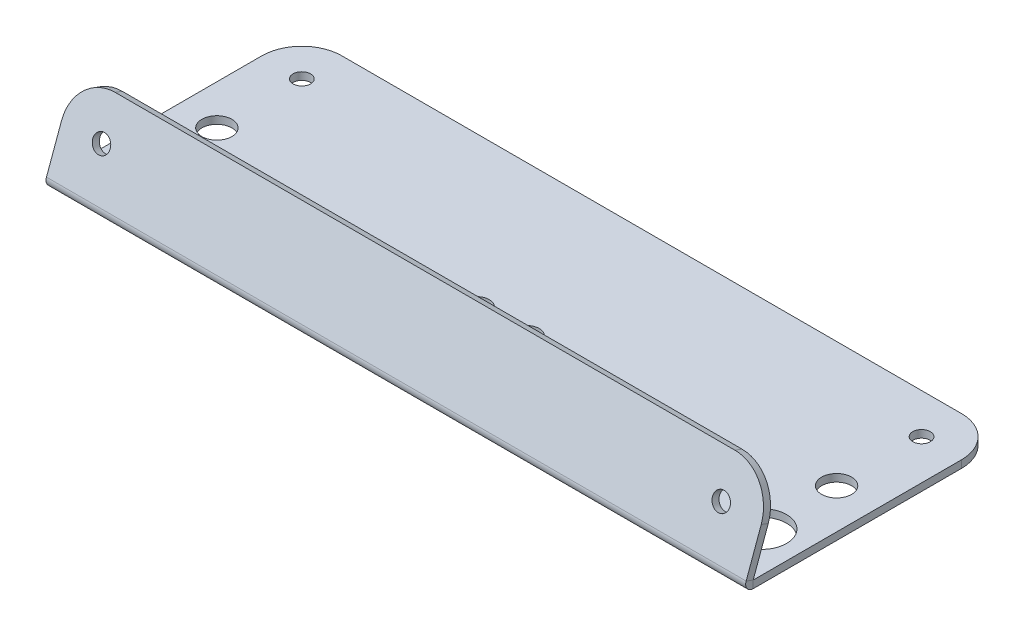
ISO-10303-21;
HEADER;
FILE_DESCRIPTION(('STEP AP214'),'2;1');
FILE_NAME('part.step','',(''),(''),'','','');
FILE_SCHEMA(('AUTOMOTIVE_DESIGN { 1 0 10303 214 1 1 1 1 }'));
ENDSEC;
DATA;
#1=APPLICATION_CONTEXT('core data for automotive mechanical design processes');
#2=APPLICATION_PROTOCOL_DEFINITION('international standard','automotive_design',2000,#1);
#3=PRODUCT_CONTEXT('',#1,'mechanical');
#4=PRODUCT('Part','Part','',(#3));
#5=PRODUCT_RELATED_PRODUCT_CATEGORY('part','',(#4));
#6=PRODUCT_DEFINITION_FORMATION('','',#4);
#7=PRODUCT_DEFINITION_CONTEXT('part definition',#1,'design');
#8=PRODUCT_DEFINITION('design','',#6,#7);
#9=PRODUCT_DEFINITION_SHAPE('','',#8);
#10=(LENGTH_UNIT() NAMED_UNIT(*) SI_UNIT(.MILLI.,.METRE.));
#11=(NAMED_UNIT(*) PLANE_ANGLE_UNIT() SI_UNIT($,.RADIAN.));
#12=(NAMED_UNIT(*) SI_UNIT($,.STERADIAN.) SOLID_ANGLE_UNIT());
#13=UNCERTAINTY_MEASURE_WITH_UNIT(LENGTH_MEASURE(1.E-05),#10,'distance_accuracy_value','');
#14=(GEOMETRIC_REPRESENTATION_CONTEXT(3) GLOBAL_UNCERTAINTY_ASSIGNED_CONTEXT((#13)) GLOBAL_UNIT_ASSIGNED_CONTEXT((#10,
#11,#12)) REPRESENTATION_CONTEXT('',''));
#15=CARTESIAN_POINT('',(0.,0.,0.));
#16=DIRECTION('',(0.,0.,1.));
#17=DIRECTION('',(1.,0.,0.));
#18=AXIS2_PLACEMENT_3D('',#15,#16,#17);
#19=CARTESIAN_POINT('',(132.,-39.0617781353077,-3.54321444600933));
#20=DIRECTION('',(0.,-0.342020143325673,-0.939692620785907));
#21=DIRECTION('',(0.,0.939692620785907,-0.342020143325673));
#22=AXIS2_PLACEMENT_3D('',#19,#20,#21);
#23=PLANE('',#22);
#24=CARTESIAN_POINT('',(132.,9.80223814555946,-21.3282618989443));
#25=DIRECTION('',(0.,-0.342020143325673,-0.939692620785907));
#26=DIRECTION('',(0.,0.939692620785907,-0.342020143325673));
#27=AXIS2_PLACEMENT_3D('',#24,#25,#26);
#28=CIRCLE('',#27,1.75000000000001);
#29=CARTESIAN_POINT('',(132.,11.4467002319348,-21.9267971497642));
#30=VERTEX_POINT('',#29);
#31=EDGE_CURVE('E173',#30,#30,#28,.T.);
#32=ORIENTED_EDGE('',*,*,#31,.F.);
#33=EDGE_LOOP('',(#32));
#34=FACE_BOUND('',#33,.T.);
#35=CARTESIAN_POINT('',(8.,9.80223814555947,-21.3282618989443));
#36=DIRECTION('',(0.,-0.342020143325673,-0.939692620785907));
#37=DIRECTION('',(0.,0.939692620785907,-0.342020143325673));
#38=AXIS2_PLACEMENT_3D('',#35,#36,#37);
#39=CIRCLE('',#38,1.75);
#40=CARTESIAN_POINT('',(8.,11.4467002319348,-21.9267971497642));
#41=VERTEX_POINT('',#40);
#42=EDGE_CURVE('E214',#41,#41,#39,.T.);
#43=ORIENTED_EDGE('',*,*,#42,.F.);
#44=EDGE_LOOP('',(#43));
#45=FACE_BOUND('',#44,.T.);
#46=DIRECTION('',(0.,-0.939692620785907,0.342020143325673));
#47=VECTOR('',#46,1.);
#48=CARTESIAN_POINT('',(140.,9.80223814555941,-21.3282618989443));
#49=LINE('',#48,#47);
#50=CARTESIAN_POINT('',(140.,9.80223814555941,-21.3282618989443));
#51=VERTEX_POINT('',#50);
#52=CARTESIAN_POINT('',(140.,1.51342019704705,-18.3113789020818));
#53=VERTEX_POINT('',#52);
#54=EDGE_CURVE('E44',#51,#53,#49,.T.);
#55=ORIENTED_EDGE('',*,*,#54,.T.);
#56=DIRECTION('',(-1.,0.,0.));
#57=VECTOR('',#56,1.);
#58=CARTESIAN_POINT('',(132.,1.51342020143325,-18.3113788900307));
#59=LINE('',#58,#57);
#60=CARTESIAN_POINT('',(0.,1.51342020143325,-18.3113788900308));
#61=VERTEX_POINT('',#60);
#62=EDGE_CURVE('E141',#53,#61,#59,.T.);
#63=ORIENTED_EDGE('',*,*,#62,.T.);
#64=DIRECTION('',(0.,0.939692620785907,-0.342020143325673));
#65=VECTOR('',#64,1.);
#66=CARTESIAN_POINT('',(0.,9.80223814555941,-21.3282618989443));
#67=LINE('',#66,#65);
#68=CARTESIAN_POINT('',(0.,9.80223814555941,-21.3282618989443));
#69=VERTEX_POINT('',#68);
#70=EDGE_CURVE('E160',#61,#69,#67,.T.);
#71=ORIENTED_EDGE('',*,*,#70,.T.);
#72=CARTESIAN_POINT('',(8.,9.80223814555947,-21.3282618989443));
#73=DIRECTION('',(0.,-0.342020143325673,-0.939692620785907));
#74=DIRECTION('',(0.,0.939692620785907,-0.342020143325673));
#75=AXIS2_PLACEMENT_3D('',#72,#73,#74);
#76=CIRCLE('',#75,8.);
#77=CARTESIAN_POINT('',(8.00000000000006,17.3197791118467,-24.0644230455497));
#78=VERTEX_POINT('',#77);
#79=EDGE_CURVE('E174',#69,#78,#76,.T.);
#80=ORIENTED_EDGE('',*,*,#79,.T.);
#81=DIRECTION('',(1.,0.,0.));
#82=VECTOR('',#81,1.);
#83=CARTESIAN_POINT('',(8.00000000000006,17.3197791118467,-24.0644230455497));
#84=LINE('',#83,#82);
#85=CARTESIAN_POINT('',(132.,17.3197791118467,-24.0644230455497));
#86=VERTEX_POINT('',#85);
#87=EDGE_CURVE('E178',#78,#86,#84,.T.);
#88=ORIENTED_EDGE('',*,*,#87,.T.);
#89=CARTESIAN_POINT('',(132.,9.80223814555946,-21.3282618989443));
#90=DIRECTION('',(0.,-0.342020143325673,-0.939692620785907));
#91=DIRECTION('',(0.,0.939692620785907,-0.342020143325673));
#92=AXIS2_PLACEMENT_3D('',#89,#90,#91);
#93=CIRCLE('',#92,8.);
#94=EDGE_CURVE('E64',#86,#51,#93,.T.);
#95=ORIENTED_EDGE('',*,*,#94,.T.);
#96=EDGE_LOOP('',(#55,#63,#71,#80,#88,#95));
#97=FACE_BOUND('',#96,.T.);
#98=ADVANCED_FACE('F40',(#34,#45,#97),#23,.T.);
#99=CARTESIAN_POINT('',(132.,-38.5487479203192,-2.13367551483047));
#100=DIRECTION('',(0.,-0.342020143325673,-0.939692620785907));
#101=DIRECTION('',(0.,0.939692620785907,-0.342020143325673));
#102=AXIS2_PLACEMENT_3D('',#99,#100,#101);
#103=PLANE('',#102);
#104=DIRECTION('',(-1.,0.,0.));
#105=VECTOR('',#104,1.);
#106=CARTESIAN_POINT('',(132.,2.02645041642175,-16.9018399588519));
#107=LINE('',#106,#105);
#108=CARTESIAN_POINT('',(140.,2.02645041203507,-16.9018399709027));
#109=VERTEX_POINT('',#108);
#110=CARTESIAN_POINT('',(0.,2.02645041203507,-16.9018399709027));
#111=VERTEX_POINT('',#110);
#112=EDGE_CURVE('E49',#109,#111,#107,.T.);
#113=ORIENTED_EDGE('',*,*,#112,.F.);
#114=DIRECTION('',(0.,-0.939692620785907,0.342020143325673));
#115=VECTOR('',#114,1.);
#116=CARTESIAN_POINT('',(140.,10.3152683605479,-19.9187229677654));
#117=LINE('',#116,#115);
#118=CARTESIAN_POINT('',(140.,10.3152683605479,-19.9187229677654));
#119=VERTEX_POINT('',#118);
#120=EDGE_CURVE('E155',#119,#109,#117,.T.);
#121=ORIENTED_EDGE('',*,*,#120,.F.);
#122=CARTESIAN_POINT('',(132.,10.315268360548,-19.9187229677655));
#123=DIRECTION('',(0.,-0.342020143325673,-0.939692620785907));
#124=DIRECTION('',(0.,0.939692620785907,-0.342020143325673));
#125=AXIS2_PLACEMENT_3D('',#122,#123,#124);
#126=CIRCLE('',#125,8.);
#127=CARTESIAN_POINT('',(132.,17.8328093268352,-22.6548841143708));
#128=VERTEX_POINT('',#127);
#129=EDGE_CURVE('E161',#128,#119,#126,.T.);
#130=ORIENTED_EDGE('',*,*,#129,.F.);
#131=DIRECTION('',(1.,0.,0.));
#132=VECTOR('',#131,1.);
#133=CARTESIAN_POINT('',(8.00000000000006,17.8328093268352,-22.6548841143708));
#134=LINE('',#133,#132);
#135=CARTESIAN_POINT('',(8.00000000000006,17.8328093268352,-22.6548841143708));
#136=VERTEX_POINT('',#135);
#137=EDGE_CURVE('E204',#136,#128,#134,.T.);
#138=ORIENTED_EDGE('',*,*,#137,.F.);
#139=CARTESIAN_POINT('',(8.,10.315268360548,-19.9187229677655));
#140=DIRECTION('',(0.,-0.342020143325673,-0.939692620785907));
#141=DIRECTION('',(0.,0.939692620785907,-0.342020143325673));
#142=AXIS2_PLACEMENT_3D('',#139,#140,#141);
#143=CIRCLE('',#142,8.);
#144=CARTESIAN_POINT('',(0.,10.3152683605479,-19.9187229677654));
#145=VERTEX_POINT('',#144);
#146=EDGE_CURVE('E172',#145,#136,#143,.T.);
#147=ORIENTED_EDGE('',*,*,#146,.F.);
#148=DIRECTION('',(0.,0.939692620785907,-0.342020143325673));
#149=VECTOR('',#148,1.);
#150=CARTESIAN_POINT('',(0.,10.3152683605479,-19.9187229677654));
#151=LINE('',#150,#149);
#152=EDGE_CURVE('E167',#111,#145,#151,.T.);
#153=ORIENTED_EDGE('',*,*,#152,.F.);
#154=EDGE_LOOP('',(#113,#121,#130,#138,#147,#153));
#155=FACE_BOUND('',#154,.T.);
#156=CARTESIAN_POINT('',(132.,10.315268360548,-19.9187229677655));
#157=DIRECTION('',(0.,-0.342020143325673,-0.939692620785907));
#158=DIRECTION('',(0.,0.939692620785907,-0.342020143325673));
#159=AXIS2_PLACEMENT_3D('',#156,#157,#158);
#160=CIRCLE('',#159,1.75000000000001);
#161=CARTESIAN_POINT('',(132.,11.9597304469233,-20.5172582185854));
#162=VERTEX_POINT('',#161);
#163=EDGE_CURVE('E211',#162,#162,#160,.T.);
#164=ORIENTED_EDGE('',*,*,#163,.T.);
#165=EDGE_LOOP('',(#164));
#166=FACE_BOUND('',#165,.T.);
#167=CARTESIAN_POINT('',(8.,10.315268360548,-19.9187229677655));
#168=DIRECTION('',(0.,-0.342020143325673,-0.939692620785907));
#169=DIRECTION('',(0.,0.939692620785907,-0.342020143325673));
#170=AXIS2_PLACEMENT_3D('',#167,#168,#169);
#171=CIRCLE('',#170,1.75);
#172=CARTESIAN_POINT('',(8.,11.9597304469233,-20.5172582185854));
#173=VERTEX_POINT('',#172);
#174=EDGE_CURVE('E217',#173,#173,#171,.T.);
#175=ORIENTED_EDGE('',*,*,#174,.T.);
#176=EDGE_LOOP('',(#175));
#177=FACE_BOUND('',#176,.T.);
#178=ADVANCED_FACE('F164',(#155,#166,#177),#103,.F.);
#179=CARTESIAN_POINT('',(0.,9.80223814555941,-21.3282618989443));
#180=DIRECTION('',(1.,0.,0.));
#181=DIRECTION('',(0.,-0.939692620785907,0.342020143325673));
#182=AXIS2_PLACEMENT_3D('',#179,#180,#181);
#183=PLANE('',#182);
#184=DIRECTION('',(0.,-0.342020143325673,-0.939692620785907));
#185=VECTOR('',#184,1.);
#186=CARTESIAN_POINT('',(0.,1.51342020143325,-18.3113788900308));
#187=LINE('',#186,#185);
#188=EDGE_CURVE('E12',#111,#61,#187,.T.);
#189=ORIENTED_EDGE('',*,*,#188,.F.);
#190=ORIENTED_EDGE('',*,*,#152,.T.);
#191=DIRECTION('',(0.,0.342020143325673,0.939692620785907));
#192=VECTOR('',#191,1.);
#193=CARTESIAN_POINT('',(0.,9.80223814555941,-21.3282618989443));
#194=LINE('',#193,#192);
#195=EDGE_CURVE('E194',#69,#145,#194,.T.);
#196=ORIENTED_EDGE('',*,*,#195,.F.);
#197=ORIENTED_EDGE('',*,*,#70,.F.);
#198=EDGE_LOOP('',(#189,#190,#196,#197));
#199=FACE_BOUND('',#198,.T.);
#200=ADVANCED_FACE('F42',(#199),#183,.F.);
#201=CARTESIAN_POINT('',(8.,9.80223814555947,-21.3282618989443));
#202=DIRECTION('',(0.,0.342020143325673,0.939692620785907));
#203=DIRECTION('',(0.,-0.939692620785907,0.342020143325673));
#204=AXIS2_PLACEMENT_3D('',#201,#202,#203);
#205=CYLINDRICAL_SURFACE('',#204,8.);
#206=ORIENTED_EDGE('',*,*,#146,.T.);
#207=DIRECTION('',(0.,0.342020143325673,0.939692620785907));
#208=VECTOR('',#207,1.);
#209=CARTESIAN_POINT('',(8.00000000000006,17.3197791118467,-24.0644230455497));
#210=LINE('',#209,#208);
#211=EDGE_CURVE('E191',#78,#136,#210,.T.);
#212=ORIENTED_EDGE('',*,*,#211,.F.);
#213=ORIENTED_EDGE('',*,*,#79,.F.);
#214=ORIENTED_EDGE('',*,*,#195,.T.);
#215=EDGE_LOOP('',(#206,#212,#213,#214));
#216=FACE_BOUND('',#215,.T.);
#217=ADVANCED_FACE('F198',(#216),#205,.T.);
#218=CARTESIAN_POINT('',(8.00000000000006,17.3197791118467,-24.0644230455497));
#219=DIRECTION('',(0.,-0.939692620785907,0.342020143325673));
#220=DIRECTION('',(-1.,0.,0.));
#221=AXIS2_PLACEMENT_3D('',#218,#219,#220);
#222=PLANE('',#221);
#223=ORIENTED_EDGE('',*,*,#137,.T.);
#224=DIRECTION('',(0.,0.342020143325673,0.939692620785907));
#225=VECTOR('',#224,1.);
#226=CARTESIAN_POINT('',(132.,17.3197791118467,-24.0644230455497));
#227=LINE('',#226,#225);
#228=EDGE_CURVE('E188',#86,#128,#227,.T.);
#229=ORIENTED_EDGE('',*,*,#228,.F.);
#230=ORIENTED_EDGE('',*,*,#87,.F.);
#231=ORIENTED_EDGE('',*,*,#211,.T.);
#232=EDGE_LOOP('',(#223,#229,#230,#231));
#233=FACE_BOUND('',#232,.T.);
#234=ADVANCED_FACE('F203',(#233),#222,.F.);
#235=CARTESIAN_POINT('',(132.,9.80223814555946,-21.3282618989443));
#236=DIRECTION('',(0.,0.342020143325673,0.939692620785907));
#237=DIRECTION('',(0.,-0.939692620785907,0.342020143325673));
#238=AXIS2_PLACEMENT_3D('',#235,#236,#237);
#239=CYLINDRICAL_SURFACE('',#238,8.);
#240=ORIENTED_EDGE('',*,*,#129,.T.);
#241=DIRECTION('',(0.,0.342020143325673,0.939692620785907));
#242=VECTOR('',#241,1.);
#243=CARTESIAN_POINT('',(140.,9.80223814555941,-21.3282618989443));
#244=LINE('',#243,#242);
#245=EDGE_CURVE('E157',#51,#119,#244,.T.);
#246=ORIENTED_EDGE('',*,*,#245,.F.);
#247=ORIENTED_EDGE('',*,*,#94,.F.);
#248=ORIENTED_EDGE('',*,*,#228,.T.);
#249=EDGE_LOOP('',(#240,#246,#247,#248));
#250=FACE_BOUND('',#249,.T.);
#251=ADVANCED_FACE('F206',(#250),#239,.T.);
#252=CARTESIAN_POINT('',(140.,9.80223814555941,-21.3282618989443));
#253=DIRECTION('',(-1.,0.,0.));
#254=DIRECTION('',(0.,0.939692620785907,-0.342020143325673));
#255=AXIS2_PLACEMENT_3D('',#252,#253,#254);
#256=PLANE('',#255);
#257=DIRECTION('',(0.,0.342020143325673,0.939692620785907));
#258=VECTOR('',#257,1.);
#259=CARTESIAN_POINT('',(140.,1.51342020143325,-18.3113788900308));
#260=LINE('',#259,#258);
#261=EDGE_CURVE('E131',#53,#109,#260,.T.);
#262=ORIENTED_EDGE('',*,*,#261,.F.);
#263=ORIENTED_EDGE('',*,*,#54,.F.);
#264=ORIENTED_EDGE('',*,*,#245,.T.);
#265=ORIENTED_EDGE('',*,*,#120,.T.);
#266=EDGE_LOOP('',(#262,#263,#264,#265));
#267=FACE_BOUND('',#266,.T.);
#268=ADVANCED_FACE('F156',(#267),#256,.F.);
#269=CARTESIAN_POINT('',(132.,9.80223814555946,-21.3282618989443));
#270=DIRECTION('',(0.,0.342020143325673,0.939692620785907));
#271=DIRECTION('',(0.,-0.939692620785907,0.342020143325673));
#272=AXIS2_PLACEMENT_3D('',#269,#270,#271);
#273=CYLINDRICAL_SURFACE('',#272,1.75000000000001);
#274=ORIENTED_EDGE('',*,*,#31,.T.);
#275=EDGE_LOOP('',(#274));
#276=FACE_BOUND('',#275,.T.);
#277=ORIENTED_EDGE('',*,*,#163,.F.);
#278=EDGE_LOOP('',(#277));
#279=FACE_BOUND('',#278,.T.);
#280=ADVANCED_FACE('F365',(#276,#279),#273,.F.);
#281=CARTESIAN_POINT('',(8.,9.80223814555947,-21.3282618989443));
#282=DIRECTION('',(0.,0.342020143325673,0.939692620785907));
#283=DIRECTION('',(0.,-0.939692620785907,0.342020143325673));
#284=AXIS2_PLACEMENT_3D('',#281,#282,#283);
#285=CYLINDRICAL_SURFACE('',#284,1.75);
#286=ORIENTED_EDGE('',*,*,#42,.T.);
#287=EDGE_LOOP('',(#286));
#288=FACE_BOUND('',#287,.T.);
#289=ORIENTED_EDGE('',*,*,#174,.F.);
#290=EDGE_LOOP('',(#289));
#291=FACE_BOUND('',#290,.T.);
#292=ADVANCED_FACE('F370',(#288,#291),#285,.F.);
#293=CARTESIAN_POINT('',(8.,1.5,-28.));
#294=DIRECTION('',(0.,-1.,0.));
#295=DIRECTION('',(0.,0.,-1.));
#296=AXIS2_PLACEMENT_3D('',#293,#294,#295);
#297=CYLINDRICAL_SURFACE('',#296,5.);
#298=CARTESIAN_POINT('',(8.,1.5,-28.));
#299=DIRECTION('',(0.,1.,0.));
#300=DIRECTION('',(0.,0.,1.));
#301=AXIS2_PLACEMENT_3D('',#298,#299,#300);
#302=CIRCLE('',#301,5.);
#303=CARTESIAN_POINT('',(8.,1.5,-23.));
#304=VERTEX_POINT('',#303);
#305=EDGE_CURVE('E223',#304,#304,#302,.T.);
#306=ORIENTED_EDGE('',*,*,#305,.T.);
#307=EDGE_LOOP('',(#306));
#308=FACE_BOUND('',#307,.T.);
#309=CARTESIAN_POINT('',(8.,0.,-28.));
#310=DIRECTION('',(0.,1.,0.));
#311=DIRECTION('',(0.,0.,1.));
#312=AXIS2_PLACEMENT_3D('',#309,#310,#311);
#313=CIRCLE('',#312,5.);
#314=CARTESIAN_POINT('',(8.,0.,-23.));
#315=VERTEX_POINT('',#314);
#316=EDGE_CURVE('E280',#315,#315,#313,.T.);
#317=ORIENTED_EDGE('',*,*,#316,.F.);
#318=EDGE_LOOP('',(#317));
#319=FACE_BOUND('',#318,.T.);
#320=ADVANCED_FACE('F380',(#308,#319),#297,.F.);
#321=CARTESIAN_POINT('',(132.,1.5,-43.));
#322=DIRECTION('',(0.,-1.,0.));
#323=DIRECTION('',(0.,0.,-1.));
#324=AXIS2_PLACEMENT_3D('',#321,#322,#323);
#325=CYLINDRICAL_SURFACE('',#324,2.99999999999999);
#326=CARTESIAN_POINT('',(132.,1.5,-43.));
#327=DIRECTION('',(0.,1.,0.));
#328=DIRECTION('',(0.,0.,1.));
#329=AXIS2_PLACEMENT_3D('',#326,#327,#328);
#330=CIRCLE('',#329,2.99999999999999);
#331=CARTESIAN_POINT('',(132.,1.5,-40.));
#332=VERTEX_POINT('',#331);
#333=EDGE_CURVE('E226',#332,#332,#330,.T.);
#334=ORIENTED_EDGE('',*,*,#333,.T.);
#335=EDGE_LOOP('',(#334));
#336=FACE_BOUND('',#335,.T.);
#337=CARTESIAN_POINT('',(132.,0.,-43.));
#338=DIRECTION('',(0.,1.,0.));
#339=DIRECTION('',(0.,0.,1.));
#340=AXIS2_PLACEMENT_3D('',#337,#338,#339);
#341=CIRCLE('',#340,2.99999999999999);
#342=CARTESIAN_POINT('',(132.,0.,-40.));
#343=VERTEX_POINT('',#342);
#344=EDGE_CURVE('E283',#343,#343,#341,.T.);
#345=ORIENTED_EDGE('',*,*,#344,.F.);
#346=EDGE_LOOP('',(#345));
#347=FACE_BOUND('',#346,.T.);
#348=ADVANCED_FACE('F552',(#336,#347),#325,.F.);
#349=CARTESIAN_POINT('',(75.,1.5,-38.));
#350=DIRECTION('',(0.,-1.,0.));
#351=DIRECTION('',(0.,0.,-1.));
#352=AXIS2_PLACEMENT_3D('',#349,#350,#351);
#353=CYLINDRICAL_SURFACE('',#352,2.5);
#354=CARTESIAN_POINT('',(75.,1.5,-38.));
#355=DIRECTION('',(0.,1.,0.));
#356=DIRECTION('',(0.,0.,1.));
#357=AXIS2_PLACEMENT_3D('',#354,#355,#356);
#358=CIRCLE('',#357,2.5);
#359=CARTESIAN_POINT('',(75.,1.5,-35.5));
#360=VERTEX_POINT('',#359);
#361=EDGE_CURVE('E229',#360,#360,#358,.T.);
#362=ORIENTED_EDGE('',*,*,#361,.T.);
#363=EDGE_LOOP('',(#362));
#364=FACE_BOUND('',#363,.T.);
#365=CARTESIAN_POINT('',(75.,0.,-38.));
#366=DIRECTION('',(0.,1.,0.));
#367=DIRECTION('',(0.,0.,1.));
#368=AXIS2_PLACEMENT_3D('',#365,#366,#367);
#369=CIRCLE('',#368,2.5);
#370=CARTESIAN_POINT('',(75.,0.,-35.5));
#371=VERTEX_POINT('',#370);
#372=EDGE_CURVE('E286',#371,#371,#369,.T.);
#373=ORIENTED_EDGE('',*,*,#372,.F.);
#374=EDGE_LOOP('',(#373));
#375=FACE_BOUND('',#374,.T.);
#376=ADVANCED_FACE('F542',(#364,#375),#353,.F.);
#377=CARTESIAN_POINT('',(132.,1.5,-60.));
#378=DIRECTION('',(0.,-1.,0.));
#379=DIRECTION('',(0.,0.,-1.));
#380=AXIS2_PLACEMENT_3D('',#377,#378,#379);
#381=CYLINDRICAL_SURFACE('',#380,1.75000000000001);
#382=CARTESIAN_POINT('',(132.,1.5,-60.));
#383=DIRECTION('',(0.,1.,0.));
#384=DIRECTION('',(0.,0.,1.));
#385=AXIS2_PLACEMENT_3D('',#382,#383,#384);
#386=CIRCLE('',#385,1.75000000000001);
#387=CARTESIAN_POINT('',(132.,1.5,-58.25));
#388=VERTEX_POINT('',#387);
#389=EDGE_CURVE('E232',#388,#388,#386,.T.);
#390=ORIENTED_EDGE('',*,*,#389,.T.);
#391=EDGE_LOOP('',(#390));
#392=FACE_BOUND('',#391,.T.);
#393=CARTESIAN_POINT('',(132.,0.,-60.));
#394=DIRECTION('',(0.,1.,0.));
#395=DIRECTION('',(0.,0.,1.));
#396=AXIS2_PLACEMENT_3D('',#393,#394,#395);
#397=CIRCLE('',#396,1.75000000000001);
#398=CARTESIAN_POINT('',(132.,0.,-58.25));
#399=VERTEX_POINT('',#398);
#400=EDGE_CURVE('E289',#399,#399,#397,.T.);
#401=ORIENTED_EDGE('',*,*,#400,.F.);
#402=EDGE_LOOP('',(#401));
#403=FACE_BOUND('',#402,.T.);
#404=ADVANCED_FACE('F532',(#392,#403),#381,.F.);
#405=CARTESIAN_POINT('',(8.,1.5,-60.));
#406=DIRECTION('',(0.,-1.,0.));
#407=DIRECTION('',(0.,0.,-1.));
#408=AXIS2_PLACEMENT_3D('',#405,#406,#407);
#409=CYLINDRICAL_SURFACE('',#408,1.75);
#410=CARTESIAN_POINT('',(8.,1.5,-60.));
#411=DIRECTION('',(0.,1.,0.));
#412=DIRECTION('',(0.,0.,1.));
#413=AXIS2_PLACEMENT_3D('',#410,#411,#412);
#414=CIRCLE('',#413,1.75);
#415=CARTESIAN_POINT('',(8.,1.5,-58.25));
#416=VERTEX_POINT('',#415);
#417=EDGE_CURVE('E235',#416,#416,#414,.T.);
#418=ORIENTED_EDGE('',*,*,#417,.T.);
#419=EDGE_LOOP('',(#418));
#420=FACE_BOUND('',#419,.T.);
#421=CARTESIAN_POINT('',(8.,0.,-60.));
#422=DIRECTION('',(0.,1.,0.));
#423=DIRECTION('',(0.,0.,1.));
#424=AXIS2_PLACEMENT_3D('',#421,#422,#423);
#425=CIRCLE('',#424,1.75);
#426=CARTESIAN_POINT('',(8.,0.,-58.25));
#427=VERTEX_POINT('',#426);
#428=EDGE_CURVE('E292',#427,#427,#425,.T.);
#429=ORIENTED_EDGE('',*,*,#428,.F.);
#430=EDGE_LOOP('',(#429));
#431=FACE_BOUND('',#430,.T.);
#432=ADVANCED_FACE('F522',(#420,#431),#409,.F.);
#433=CARTESIAN_POINT('',(65.,1.5,-38.));
#434=DIRECTION('',(0.,-1.,0.));
#435=DIRECTION('',(0.,0.,-1.));
#436=AXIS2_PLACEMENT_3D('',#433,#434,#435);
#437=CYLINDRICAL_SURFACE('',#436,2.5);
#438=CARTESIAN_POINT('',(65.,1.5,-38.));
#439=DIRECTION('',(0.,1.,0.));
#440=DIRECTION('',(0.,0.,1.));
#441=AXIS2_PLACEMENT_3D('',#438,#439,#440);
#442=CIRCLE('',#441,2.5);
#443=CARTESIAN_POINT('',(65.,1.5,-35.5));
#444=VERTEX_POINT('',#443);
#445=EDGE_CURVE('E238',#444,#444,#442,.T.);
#446=ORIENTED_EDGE('',*,*,#445,.T.);
#447=EDGE_LOOP('',(#446));
#448=FACE_BOUND('',#447,.T.);
#449=CARTESIAN_POINT('',(65.,0.,-38.));
#450=DIRECTION('',(0.,1.,0.));
#451=DIRECTION('',(0.,0.,1.));
#452=AXIS2_PLACEMENT_3D('',#449,#450,#451);
#453=CIRCLE('',#452,2.5);
#454=CARTESIAN_POINT('',(65.,0.,-35.5));
#455=VERTEX_POINT('',#454);
#456=EDGE_CURVE('E295',#455,#455,#453,.T.);
#457=ORIENTED_EDGE('',*,*,#456,.F.);
#458=EDGE_LOOP('',(#457));
#459=FACE_BOUND('',#458,.T.);
#460=ADVANCED_FACE('F512',(#448,#459),#437,.F.);
#461=CARTESIAN_POINT('',(8.,1.5,-43.));
#462=DIRECTION('',(0.,-1.,0.));
#463=DIRECTION('',(0.,0.,-1.));
#464=AXIS2_PLACEMENT_3D('',#461,#462,#463);
#465=CYLINDRICAL_SURFACE('',#464,3.);
#466=CARTESIAN_POINT('',(8.,1.5,-43.));
#467=DIRECTION('',(0.,1.,0.));
#468=DIRECTION('',(0.,0.,1.));
#469=AXIS2_PLACEMENT_3D('',#466,#467,#468);
#470=CIRCLE('',#469,3.);
#471=CARTESIAN_POINT('',(8.,1.5,-40.));
#472=VERTEX_POINT('',#471);
#473=EDGE_CURVE('E241',#472,#472,#470,.T.);
#474=ORIENTED_EDGE('',*,*,#473,.T.);
#475=EDGE_LOOP('',(#474));
#476=FACE_BOUND('',#475,.T.);
#477=CARTESIAN_POINT('',(8.,0.,-43.));
#478=DIRECTION('',(0.,1.,0.));
#479=DIRECTION('',(0.,0.,1.));
#480=AXIS2_PLACEMENT_3D('',#477,#478,#479);
#481=CIRCLE('',#480,3.);
#482=CARTESIAN_POINT('',(8.,0.,-40.));
#483=VERTEX_POINT('',#482);
#484=EDGE_CURVE('E298',#483,#483,#481,.T.);
#485=ORIENTED_EDGE('',*,*,#484,.F.);
#486=EDGE_LOOP('',(#485));
#487=FACE_BOUND('',#486,.T.);
#488=ADVANCED_FACE('F502',(#476,#487),#465,.F.);
#489=CARTESIAN_POINT('',(132.,1.5,-28.));
#490=DIRECTION('',(0.,-1.,0.));
#491=DIRECTION('',(0.,0.,-1.));
#492=AXIS2_PLACEMENT_3D('',#489,#490,#491);
#493=CYLINDRICAL_SURFACE('',#492,4.99999999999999);
#494=CARTESIAN_POINT('',(132.,1.5,-28.));
#495=DIRECTION('',(0.,1.,0.));
#496=DIRECTION('',(0.,0.,1.));
#497=AXIS2_PLACEMENT_3D('',#494,#495,#496);
#498=CIRCLE('',#497,4.99999999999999);
#499=CARTESIAN_POINT('',(132.,1.5,-23.));
#500=VERTEX_POINT('',#499);
#501=EDGE_CURVE('E244',#500,#500,#498,.T.);
#502=ORIENTED_EDGE('',*,*,#501,.T.);
#503=EDGE_LOOP('',(#502));
#504=FACE_BOUND('',#503,.T.);
#505=CARTESIAN_POINT('',(132.,0.,-28.));
#506=DIRECTION('',(0.,1.,0.));
#507=DIRECTION('',(0.,0.,1.));
#508=AXIS2_PLACEMENT_3D('',#505,#506,#507);
#509=CIRCLE('',#508,4.99999999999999);
#510=CARTESIAN_POINT('',(132.,0.,-23.));
#511=VERTEX_POINT('',#510);
#512=EDGE_CURVE('E301',#511,#511,#509,.T.);
#513=ORIENTED_EDGE('',*,*,#512,.F.);
#514=EDGE_LOOP('',(#513));
#515=FACE_BOUND('',#514,.T.);
#516=ADVANCED_FACE('F493',(#504,#515),#493,.F.);
#517=CARTESIAN_POINT('',(8.,1.5,-60.));
#518=DIRECTION('',(0.,-1.,0.));
#519=DIRECTION('',(0.,0.,-1.));
#520=AXIS2_PLACEMENT_3D('',#517,#518,#519);
#521=CYLINDRICAL_SURFACE('',#520,8.);
#522=CARTESIAN_POINT('',(8.,0.,-60.));
#523=DIRECTION('',(0.,1.,0.));
#524=DIRECTION('',(0.,0.,-1.));
#525=AXIS2_PLACEMENT_3D('',#522,#523,#524);
#526=CIRCLE('',#525,8.);
#527=CARTESIAN_POINT('',(8.00000000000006,0.,-68.));
#528=VERTEX_POINT('',#527);
#529=CARTESIAN_POINT('',(0.,0.,-60.));
#530=VERTEX_POINT('',#529);
#531=EDGE_CURVE('E247',#528,#530,#526,.T.);
#532=ORIENTED_EDGE('',*,*,#531,.T.);
#533=DIRECTION('',(0.,-1.,0.));
#534=VECTOR('',#533,1.);
#535=CARTESIAN_POINT('',(0.,1.5,-60.));
#536=LINE('',#535,#534);
#537=CARTESIAN_POINT('',(0.,1.5,-60.));
#538=VERTEX_POINT('',#537);
#539=EDGE_CURVE('E220',#538,#530,#536,.T.);
#540=ORIENTED_EDGE('',*,*,#539,.F.);
#541=CARTESIAN_POINT('',(8.,1.5,-60.));
#542=DIRECTION('',(0.,1.,0.));
#543=DIRECTION('',(0.,0.,-1.));
#544=AXIS2_PLACEMENT_3D('',#541,#542,#543);
#545=CIRCLE('',#544,8.);
#546=CARTESIAN_POINT('',(8.00000000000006,1.5,-68.));
#547=VERTEX_POINT('',#546);
#548=EDGE_CURVE('E270',#547,#538,#545,.T.);
#549=ORIENTED_EDGE('',*,*,#548,.F.);
#550=DIRECTION('',(0.,-1.,0.));
#551=VECTOR('',#550,1.);
#552=CARTESIAN_POINT('',(8.00000000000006,1.5,-68.));
#553=LINE('',#552,#551);
#554=EDGE_CURVE('E249',#547,#528,#553,.T.);
#555=ORIENTED_EDGE('',*,*,#554,.T.);
#556=EDGE_LOOP('',(#532,#540,#549,#555));
#557=FACE_BOUND('',#556,.T.);
#558=ADVANCED_FACE('F338',(#557),#521,.T.);
#559=CARTESIAN_POINT('',(8.00000000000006,1.5,-68.));
#560=DIRECTION('',(0.,0.,1.));
#561=DIRECTION('',(1.,0.,0.));
#562=AXIS2_PLACEMENT_3D('',#559,#560,#561);
#563=PLANE('',#562);
#564=DIRECTION('',(-1.,0.,0.));
#565=VECTOR('',#564,1.);
#566=CARTESIAN_POINT('',(8.00000000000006,0.,-68.));
#567=LINE('',#566,#565);
#568=CARTESIAN_POINT('',(132.,0.,-68.));
#569=VERTEX_POINT('',#568);
#570=EDGE_CURVE('E252',#569,#528,#567,.T.);
#571=ORIENTED_EDGE('',*,*,#570,.T.);
#572=ORIENTED_EDGE('',*,*,#554,.F.);
#573=DIRECTION('',(-1.,0.,0.));
#574=VECTOR('',#573,1.);
#575=CARTESIAN_POINT('',(8.00000000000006,1.5,-68.));
#576=LINE('',#575,#574);
#577=CARTESIAN_POINT('',(132.,1.5,-68.));
#578=VERTEX_POINT('',#577);
#579=EDGE_CURVE('E268',#578,#547,#576,.T.);
#580=ORIENTED_EDGE('',*,*,#579,.F.);
#581=DIRECTION('',(0.,-1.,0.));
#582=VECTOR('',#581,1.);
#583=CARTESIAN_POINT('',(132.,1.5,-68.));
#584=LINE('',#583,#582);
#585=EDGE_CURVE('E254',#578,#569,#584,.T.);
#586=ORIENTED_EDGE('',*,*,#585,.T.);
#587=EDGE_LOOP('',(#571,#572,#580,#586));
#588=FACE_BOUND('',#587,.T.);
#589=ADVANCED_FACE('F341',(#588),#563,.F.);
#590=CARTESIAN_POINT('',(132.,1.5,-60.));
#591=DIRECTION('',(0.,-1.,0.));
#592=DIRECTION('',(0.,0.,-1.));
#593=AXIS2_PLACEMENT_3D('',#590,#591,#592);
#594=CYLINDRICAL_SURFACE('',#593,8.);
#595=CARTESIAN_POINT('',(132.,0.,-60.));
#596=DIRECTION('',(0.,1.,0.));
#597=DIRECTION('',(0.,0.,1.));
#598=AXIS2_PLACEMENT_3D('',#595,#596,#597);
#599=CIRCLE('',#598,8.);
#600=CARTESIAN_POINT('',(140.,0.,-60.));
#601=VERTEX_POINT('',#600);
#602=EDGE_CURVE('E257',#601,#569,#599,.T.);
#603=ORIENTED_EDGE('',*,*,#602,.T.);
#604=ORIENTED_EDGE('',*,*,#585,.F.);
#605=CARTESIAN_POINT('',(132.,1.5,-60.));
#606=DIRECTION('',(0.,1.,0.));
#607=DIRECTION('',(0.,0.,1.));
#608=AXIS2_PLACEMENT_3D('',#605,#606,#607);
#609=CIRCLE('',#608,8.);
#610=CARTESIAN_POINT('',(140.,1.5,-60.));
#611=VERTEX_POINT('',#610);
#612=EDGE_CURVE('E265',#611,#578,#609,.T.);
#613=ORIENTED_EDGE('',*,*,#612,.F.);
#614=DIRECTION('',(0.,-1.,0.));
#615=VECTOR('',#614,1.);
#616=CARTESIAN_POINT('',(140.,1.5,-60.));
#617=LINE('',#616,#615);
#618=EDGE_CURVE('E260',#611,#601,#617,.T.);
#619=ORIENTED_EDGE('',*,*,#618,.T.);
#620=EDGE_LOOP('',(#603,#604,#613,#619));
#621=FACE_BOUND('',#620,.T.);
#622=ADVANCED_FACE('F344',(#621),#594,.T.);
#623=CARTESIAN_POINT('',(132.,1.5,-60.));
#624=DIRECTION('',(0.,1.,0.));
#625=DIRECTION('',(0.,0.,1.));
#626=AXIS2_PLACEMENT_3D('',#623,#624,#625);
#627=PLANE('',#626);
#628=DIRECTION('',(-1.,0.,0.));
#629=VECTOR('',#628,1.);
#630=CARTESIAN_POINT('',(132.,1.5,-18.3207758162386));
#631=LINE('',#630,#629);
#632=CARTESIAN_POINT('',(140.,1.5000000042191,-18.3207758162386));
#633=VERTEX_POINT('',#632);
#634=CARTESIAN_POINT('',(0.,1.50000001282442,-18.3207758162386));
#635=VERTEX_POINT('',#634);
#636=EDGE_CURVE('E221',#633,#635,#631,.T.);
#637=ORIENTED_EDGE('',*,*,#636,.F.);
#638=DIRECTION('',(0.,0.,-1.));
#639=VECTOR('',#638,1.);
#640=CARTESIAN_POINT('',(140.,1.5,-8.00000000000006));
#641=LINE('',#640,#639);
#642=EDGE_CURVE('E263',#633,#611,#641,.T.);
#643=ORIENTED_EDGE('',*,*,#642,.T.);
#644=ORIENTED_EDGE('',*,*,#612,.T.);
#645=ORIENTED_EDGE('',*,*,#579,.T.);
#646=ORIENTED_EDGE('',*,*,#548,.T.);
#647=DIRECTION('',(0.,0.,1.));
#648=VECTOR('',#647,1.);
#649=CARTESIAN_POINT('',(0.,1.5,-8.00000000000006));
#650=LINE('',#649,#648);
#651=EDGE_CURVE('E272',#538,#635,#650,.T.);
#652=ORIENTED_EDGE('',*,*,#651,.T.);
#653=EDGE_LOOP('',(#637,#643,#644,#645,#646,#652));
#654=FACE_BOUND('',#653,.T.);
#655=ORIENTED_EDGE('',*,*,#501,.F.);
#656=EDGE_LOOP('',(#655));
#657=FACE_BOUND('',#656,.T.);
#658=ORIENTED_EDGE('',*,*,#473,.F.);
#659=EDGE_LOOP('',(#658));
#660=FACE_BOUND('',#659,.T.);
#661=ORIENTED_EDGE('',*,*,#445,.F.);
#662=EDGE_LOOP('',(#661));
#663=FACE_BOUND('',#662,.T.);
#664=ORIENTED_EDGE('',*,*,#417,.F.);
#665=EDGE_LOOP('',(#664));
#666=FACE_BOUND('',#665,.T.);
#667=ORIENTED_EDGE('',*,*,#389,.F.);
#668=EDGE_LOOP('',(#667));
#669=FACE_BOUND('',#668,.T.);
#670=ORIENTED_EDGE('',*,*,#361,.F.);
#671=EDGE_LOOP('',(#670));
#672=FACE_BOUND('',#671,.T.);
#673=ORIENTED_EDGE('',*,*,#333,.F.);
#674=EDGE_LOOP('',(#673));
#675=FACE_BOUND('',#674,.T.);
#676=ORIENTED_EDGE('',*,*,#305,.F.);
#677=EDGE_LOOP('',(#676));
#678=FACE_BOUND('',#677,.T.);
#679=ADVANCED_FACE('F333',(#654,#657,#660,#663,#666,#669,#672,#675,#678),#627,.T.);
#680=CARTESIAN_POINT('',(140.,1.5,-8.00000000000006));
#681=DIRECTION('',(-1.,0.,0.));
#682=DIRECTION('',(0.,0.,1.));
#683=AXIS2_PLACEMENT_3D('',#680,#681,#682);
#684=PLANE('',#683);
#685=ORIENTED_EDGE('',*,*,#642,.F.);
#686=DIRECTION('',(0.,-1.,0.));
#687=VECTOR('',#686,1.);
#688=CARTESIAN_POINT('',(140.,1.5,-18.3207758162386));
#689=LINE('',#688,#687);
#690=CARTESIAN_POINT('',(140.,0.,-18.3207758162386));
#691=VERTEX_POINT('',#690);
#692=EDGE_CURVE('E275',#633,#691,#689,.T.);
#693=ORIENTED_EDGE('',*,*,#692,.T.);
#694=DIRECTION('',(0.,0.,-1.));
#695=VECTOR('',#694,1.);
#696=CARTESIAN_POINT('',(140.,0.,-8.00000000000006));
#697=LINE('',#696,#695);
#698=EDGE_CURVE('E278',#691,#601,#697,.T.);
#699=ORIENTED_EDGE('',*,*,#698,.T.);
#700=ORIENTED_EDGE('',*,*,#618,.F.);
#701=EDGE_LOOP('',(#685,#693,#699,#700));
#702=FACE_BOUND('',#701,.T.);
#703=ADVANCED_FACE('F329',(#702),#684,.F.);
#704=CARTESIAN_POINT('',(132.,0.,-60.));
#705=DIRECTION('',(0.,1.,0.));
#706=DIRECTION('',(0.,0.,1.));
#707=AXIS2_PLACEMENT_3D('',#704,#705,#706);
#708=PLANE('',#707);
#709=ORIENTED_EDGE('',*,*,#316,.T.);
#710=EDGE_LOOP('',(#709));
#711=FACE_BOUND('',#710,.T.);
#712=ORIENTED_EDGE('',*,*,#344,.T.);
#713=EDGE_LOOP('',(#712));
#714=FACE_BOUND('',#713,.T.);
#715=ORIENTED_EDGE('',*,*,#372,.T.);
#716=EDGE_LOOP('',(#715));
#717=FACE_BOUND('',#716,.T.);
#718=ORIENTED_EDGE('',*,*,#400,.T.);
#719=EDGE_LOOP('',(#718));
#720=FACE_BOUND('',#719,.T.);
#721=ORIENTED_EDGE('',*,*,#428,.T.);
#722=EDGE_LOOP('',(#721));
#723=FACE_BOUND('',#722,.T.);
#724=ORIENTED_EDGE('',*,*,#456,.T.);
#725=EDGE_LOOP('',(#724));
#726=FACE_BOUND('',#725,.T.);
#727=ORIENTED_EDGE('',*,*,#484,.T.);
#728=EDGE_LOOP('',(#727));
#729=FACE_BOUND('',#728,.T.);
#730=ORIENTED_EDGE('',*,*,#512,.T.);
#731=EDGE_LOOP('',(#730));
#732=FACE_BOUND('',#731,.T.);
#733=ORIENTED_EDGE('',*,*,#698,.F.);
#734=DIRECTION('',(-1.,0.,0.));
#735=VECTOR('',#734,1.);
#736=CARTESIAN_POINT('',(132.,0.,-18.3207758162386));
#737=LINE('',#736,#735);
#738=CARTESIAN_POINT('',(0.,1.28244155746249E-08,-18.3207758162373));
#739=VERTEX_POINT('',#738);
#740=EDGE_CURVE('E149',#691,#739,#737,.T.);
#741=ORIENTED_EDGE('',*,*,#740,.T.);
#742=DIRECTION('',(0.,0.,1.));
#743=VECTOR('',#742,1.);
#744=CARTESIAN_POINT('',(0.,0.,-8.00000000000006));
#745=LINE('',#744,#743);
#746=EDGE_CURVE('E305',#530,#739,#745,.T.);
#747=ORIENTED_EDGE('',*,*,#746,.F.);
#748=ORIENTED_EDGE('',*,*,#531,.F.);
#749=ORIENTED_EDGE('',*,*,#570,.F.);
#750=ORIENTED_EDGE('',*,*,#602,.F.);
#751=EDGE_LOOP('',(#733,#741,#747,#748,#749,#750));
#752=FACE_BOUND('',#751,.T.);
#753=ADVANCED_FACE('F324',(#711,#714,#717,#720,#723,#726,#729,#732,#752),#708,.F.);
#754=CARTESIAN_POINT('',(0.,1.5,-8.00000000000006));
#755=DIRECTION('',(1.,0.,0.));
#756=DIRECTION('',(0.,0.,-1.));
#757=AXIS2_PLACEMENT_3D('',#754,#755,#756);
#758=PLANE('',#757);
#759=ORIENTED_EDGE('',*,*,#746,.T.);
#760=DIRECTION('',(0.,1.,0.));
#761=VECTOR('',#760,1.);
#762=CARTESIAN_POINT('',(0.,1.5,-18.3207758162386));
#763=LINE('',#762,#761);
#764=EDGE_CURVE('E308',#739,#635,#763,.T.);
#765=ORIENTED_EDGE('',*,*,#764,.T.);
#766=ORIENTED_EDGE('',*,*,#651,.F.);
#767=ORIENTED_EDGE('',*,*,#539,.T.);
#768=EDGE_LOOP('',(#759,#765,#766,#767));
#769=FACE_BOUND('',#768,.T.);
#770=ADVANCED_FACE('F319',(#769),#758,.F.);
#771=CARTESIAN_POINT('',(140.,1.50999998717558,-18.3207758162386));
#772=DIRECTION('',(-1.,0.,0.));
#773=DIRECTION('',(0.,0.,1.));
#774=AXIS2_PLACEMENT_3D('',#771,#772,#773);
#775=PLANE('',#774);
#776=ORIENTED_EDGE('',*,*,#261,.T.);
#777=CARTESIAN_POINT('',(140.,1.51,-18.3207758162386));
#778=DIRECTION('',(1.,0.,0.));
#779=DIRECTION('',(0.,0.,-1.));
#780=AXIS2_PLACEMENT_3D('',#777,#778,#779);
#781=CIRCLE('',#780,1.50999998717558);
#782=EDGE_CURVE('E134',#109,#691,#781,.T.);
#783=ORIENTED_EDGE('',*,*,#782,.T.);
#784=ORIENTED_EDGE('',*,*,#692,.F.);
#785=CARTESIAN_POINT('',(140.,1.50999998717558,-18.3207758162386));
#786=DIRECTION('',(1.,0.,0.));
#787=DIRECTION('',(0.,0.,-1.));
#788=AXIS2_PLACEMENT_3D('',#785,#786,#787);
#789=CIRCLE('',#788,0.00999998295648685);
#790=EDGE_CURVE('E137',#53,#633,#789,.T.);
#791=ORIENTED_EDGE('',*,*,#790,.F.);
#792=EDGE_LOOP('',(#776,#783,#784,#791));
#793=FACE_BOUND('',#792,.T.);
#794=ADVANCED_FACE('F133',(#793),#775,.F.);
#795=CARTESIAN_POINT('',(0.,1.50999998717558,-18.3207758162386));
#796=DIRECTION('',(1.,0.,0.));
#797=DIRECTION('',(0.,0.,-1.));
#798=AXIS2_PLACEMENT_3D('',#795,#796,#797);
#799=PLANE('',#798);
#800=CARTESIAN_POINT('',(0.,1.51,-18.3207758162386));
#801=DIRECTION('',(1.,0.,0.));
#802=DIRECTION('',(0.,0.,-1.));
#803=AXIS2_PLACEMENT_3D('',#800,#801,#802);
#804=CIRCLE('',#803,1.50999998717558);
#805=EDGE_CURVE('E151',#739,#111,#804,.F.);
#806=ORIENTED_EDGE('',*,*,#805,.T.);
#807=ORIENTED_EDGE('',*,*,#188,.T.);
#808=CARTESIAN_POINT('',(0.,1.50999998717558,-18.3207758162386));
#809=DIRECTION('',(-1.,0.,0.));
#810=DIRECTION('',(0.,0.,1.));
#811=AXIS2_PLACEMENT_3D('',#808,#809,#810);
#812=CIRCLE('',#811,0.00999998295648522);
#813=EDGE_CURVE('E57',#635,#61,#812,.T.);
#814=ORIENTED_EDGE('',*,*,#813,.F.);
#815=ORIENTED_EDGE('',*,*,#764,.F.);
#816=EDGE_LOOP('',(#806,#807,#814,#815));
#817=FACE_BOUND('',#816,.T.);
#818=ADVANCED_FACE('F316',(#817),#799,.F.);
#819=CARTESIAN_POINT('',(-70.0160705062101,1.51,-18.3207758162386));
#820=DIRECTION('',(1.,0.,0.));
#821=DIRECTION('',(0.,0.,-1.));
#822=AXIS2_PLACEMENT_3D('',#819,#820,#821);
#823=CYLINDRICAL_SURFACE('',#822,0.0099999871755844);
#824=ORIENTED_EDGE('',*,*,#636,.T.);
#825=ORIENTED_EDGE('',*,*,#813,.T.);
#826=ORIENTED_EDGE('',*,*,#62,.F.);
#827=ORIENTED_EDGE('',*,*,#790,.T.);
#828=EDGE_LOOP('',(#824,#825,#826,#827));
#829=FACE_BOUND('',#828,.T.);
#830=ADVANCED_FACE('F331',(#829),#823,.F.);
#831=CARTESIAN_POINT('',(-70.0160705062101,1.51,-18.3207758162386));
#832=DIRECTION('',(1.,0.,0.));
#833=DIRECTION('',(0.,0.,-1.));
#834=AXIS2_PLACEMENT_3D('',#831,#832,#833);
#835=CYLINDRICAL_SURFACE('',#834,1.50999998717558);
#836=ORIENTED_EDGE('',*,*,#740,.F.);
#837=ORIENTED_EDGE('',*,*,#782,.F.);
#838=ORIENTED_EDGE('',*,*,#112,.T.);
#839=ORIENTED_EDGE('',*,*,#805,.F.);
#840=EDGE_LOOP('',(#836,#837,#838,#839));
#841=FACE_BOUND('',#840,.T.);
#842=ADVANCED_FACE('F144',(#841),#835,.T.);
#843=CLOSED_SHELL('',(#98,#178,#200,#217,#234,#251,#268,#280,#292,#320,#348,#376,#404,#432,#460,
#488,#516,#558,#589,#622,#679,#703,#753,#770,#794,#818,#830,#842));
#844=MANIFOLD_SOLID_BREP('B2',#843);
#845=ADVANCED_BREP_SHAPE_REPRESENTATION('',(#18,#844),#14);
#846=SHAPE_DEFINITION_REPRESENTATION(#9,#845);
ENDSEC;
END-ISO-10303-21;
